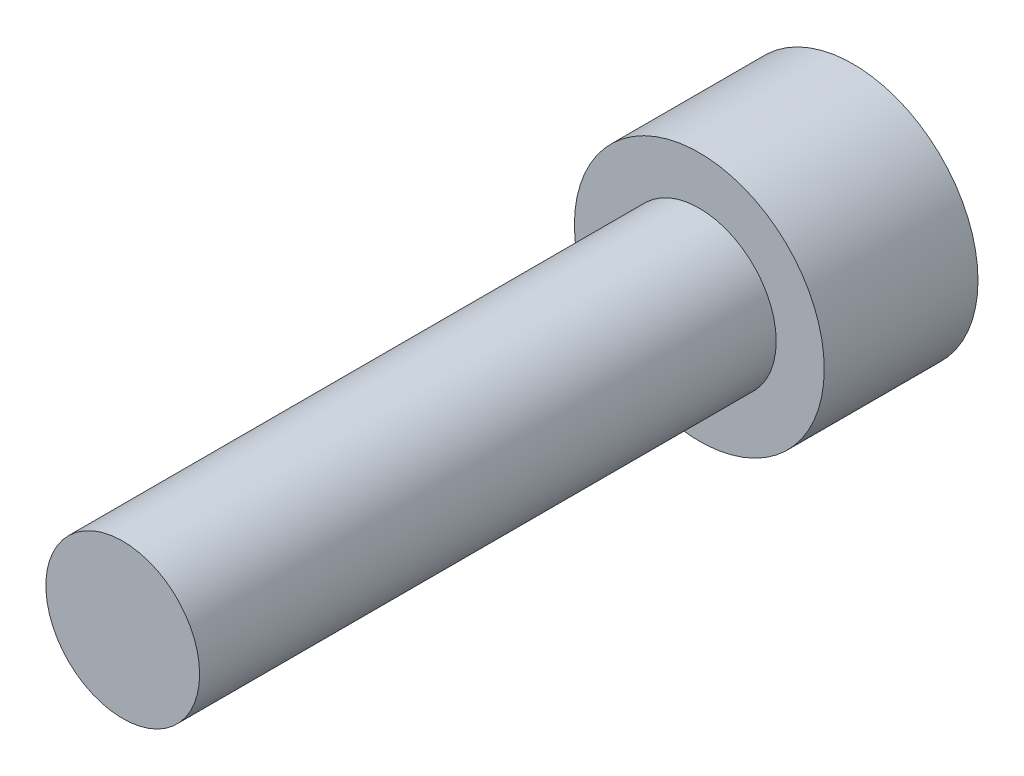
ISO-10303-21;
HEADER;
FILE_DESCRIPTION(('STEP AP214'),'2;1');
FILE_NAME('part.step','',(''),(''),'','','');
FILE_SCHEMA(('AUTOMOTIVE_DESIGN { 1 0 10303 214 1 1 1 1 }'));
ENDSEC;
DATA;
#1=APPLICATION_CONTEXT('core data for automotive mechanical design processes');
#2=APPLICATION_PROTOCOL_DEFINITION('international standard','automotive_design',2000,#1);
#3=PRODUCT_CONTEXT('',#1,'mechanical');
#4=PRODUCT('Part','Part','',(#3));
#5=PRODUCT_RELATED_PRODUCT_CATEGORY('part','',(#4));
#6=PRODUCT_DEFINITION_FORMATION('','',#4);
#7=PRODUCT_DEFINITION_CONTEXT('part definition',#1,'design');
#8=PRODUCT_DEFINITION('design','',#6,#7);
#9=PRODUCT_DEFINITION_SHAPE('','',#8);
#10=(LENGTH_UNIT() NAMED_UNIT(*) SI_UNIT(.MILLI.,.METRE.));
#11=(NAMED_UNIT(*) PLANE_ANGLE_UNIT() SI_UNIT($,.RADIAN.));
#12=(NAMED_UNIT(*) SI_UNIT($,.STERADIAN.) SOLID_ANGLE_UNIT());
#13=UNCERTAINTY_MEASURE_WITH_UNIT(LENGTH_MEASURE(1.E-05),#10,'distance_accuracy_value','');
#14=(GEOMETRIC_REPRESENTATION_CONTEXT(3) GLOBAL_UNCERTAINTY_ASSIGNED_CONTEXT((#13)) GLOBAL_UNIT_ASSIGNED_CONTEXT((#10,
#11,#12)) REPRESENTATION_CONTEXT('',''));
#15=CARTESIAN_POINT('',(0.,0.,0.));
#16=DIRECTION('',(0.,0.,1.));
#17=DIRECTION('',(1.,0.,0.));
#18=AXIS2_PLACEMENT_3D('',#15,#16,#17);
#19=CARTESIAN_POINT('',(0.,0.,30.));
#20=DIRECTION('',(0.,0.,1.));
#21=DIRECTION('',(1.,0.,0.));
#22=AXIS2_PLACEMENT_3D('',#19,#20,#21);
#23=PLANE('',#22);
#24=CARTESIAN_POINT('',(0.,0.,30.));
#25=DIRECTION('',(0.,0.,1.));
#26=DIRECTION('',(1.,0.,0.));
#27=AXIS2_PLACEMENT_3D('',#24,#25,#26);
#28=CIRCLE('',#27,4.);
#29=CARTESIAN_POINT('',(4.,0.,30.));
#30=VERTEX_POINT('',#29);
#31=EDGE_CURVE('E11',#30,#30,#28,.T.);
#32=ORIENTED_EDGE('',*,*,#31,.T.);
#33=EDGE_LOOP('',(#32));
#34=FACE_BOUND('',#33,.T.);
#35=ADVANCED_FACE('F33',(#34),#23,.T.);
#36=CARTESIAN_POINT('',(0.,0.,30.));
#37=DIRECTION('',(0.,0.,1.));
#38=DIRECTION('',(1.,0.,0.));
#39=AXIS2_PLACEMENT_3D('',#36,#37,#38);
#40=CYLINDRICAL_SURFACE('',#39,4.);
#41=CARTESIAN_POINT('',(0.,0.,0.));
#42=DIRECTION('',(0.,0.,1.));
#43=DIRECTION('',(1.,0.,0.));
#44=AXIS2_PLACEMENT_3D('',#41,#42,#43);
#45=CIRCLE('',#44,4.);
#46=CARTESIAN_POINT('',(4.,0.,0.));
#47=VERTEX_POINT('',#46);
#48=EDGE_CURVE('E40',#47,#47,#45,.T.);
#49=ORIENTED_EDGE('',*,*,#48,.T.);
#50=EDGE_LOOP('',(#49));
#51=FACE_BOUND('',#50,.T.);
#52=ORIENTED_EDGE('',*,*,#31,.F.);
#53=EDGE_LOOP('',(#52));
#54=FACE_BOUND('',#53,.T.);
#55=ADVANCED_FACE('F147',(#51,#54),#40,.T.);
#56=CARTESIAN_POINT('',(0.,-4.,0.));
#57=DIRECTION('',(0.,0.,1.));
#58=DIRECTION('',(1.,0.,0.));
#59=AXIS2_PLACEMENT_3D('',#56,#57,#58);
#60=PLANE('',#59);
#61=CARTESIAN_POINT('',(0.,0.,0.));
#62=DIRECTION('',(0.,0.,1.));
#63=DIRECTION('',(1.,0.,0.));
#64=AXIS2_PLACEMENT_3D('',#61,#62,#63);
#65=CIRCLE('',#64,6.5);
#66=CARTESIAN_POINT('',(6.5,0.,0.));
#67=VERTEX_POINT('',#66);
#68=EDGE_CURVE('E142',#67,#67,#65,.T.);
#69=ORIENTED_EDGE('',*,*,#68,.T.);
#70=EDGE_LOOP('',(#69));
#71=FACE_BOUND('',#70,.T.);
#72=ORIENTED_EDGE('',*,*,#48,.F.);
#73=EDGE_LOOP('',(#72));
#74=FACE_BOUND('',#73,.T.);
#75=ADVANCED_FACE('F150',(#71,#74),#60,.T.);
#76=CARTESIAN_POINT('',(0.,0.,30.));
#77=DIRECTION('',(0.,0.,1.));
#78=DIRECTION('',(1.,0.,0.));
#79=AXIS2_PLACEMENT_3D('',#76,#77,#78);
#80=CYLINDRICAL_SURFACE('',#79,6.5);
#81=CARTESIAN_POINT('',(0.,0.,-8.));
#82=DIRECTION('',(0.,0.,1.));
#83=DIRECTION('',(1.,0.,0.));
#84=AXIS2_PLACEMENT_3D('',#81,#82,#83);
#85=CIRCLE('',#84,6.5);
#86=CARTESIAN_POINT('',(6.5,0.,-8.));
#87=VERTEX_POINT('',#86);
#88=EDGE_CURVE('E134',#87,#87,#85,.T.);
#89=ORIENTED_EDGE('',*,*,#88,.T.);
#90=EDGE_LOOP('',(#89));
#91=FACE_BOUND('',#90,.T.);
#92=ORIENTED_EDGE('',*,*,#68,.F.);
#93=EDGE_LOOP('',(#92));
#94=FACE_BOUND('',#93,.T.);
#95=ADVANCED_FACE('F152',(#91,#94),#80,.T.);
#96=CARTESIAN_POINT('',(0.,-6.5,-8.));
#97=DIRECTION('',(0.,0.,-1.));
#98=DIRECTION('',(-1.,0.,0.));
#99=AXIS2_PLACEMENT_3D('',#96,#97,#98);
#100=PLANE('',#99);
#101=DIRECTION('',(0.866025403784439,-0.5,0.));
#102=VECTOR('',#101,1.);
#103=CARTESIAN_POINT('',(0.,3.46410161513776,-8.));
#104=LINE('',#103,#102);
#105=CARTESIAN_POINT('',(0.,3.46410161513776,-8.));
#106=VERTEX_POINT('',#105);
#107=CARTESIAN_POINT('',(3.,1.73205080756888,-8.));
#108=VERTEX_POINT('',#107);
#109=EDGE_CURVE('E47',#106,#108,#104,.T.);
#110=ORIENTED_EDGE('',*,*,#109,.F.);
#111=DIRECTION('',(0.866025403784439,0.5,0.));
#112=VECTOR('',#111,1.);
#113=CARTESIAN_POINT('',(-3.,1.73205080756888,-8.));
#114=LINE('',#113,#112);
#115=CARTESIAN_POINT('',(-3.,1.73205080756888,-8.));
#116=VERTEX_POINT('',#115);
#117=EDGE_CURVE('E130',#116,#106,#114,.T.);
#118=ORIENTED_EDGE('',*,*,#117,.F.);
#119=DIRECTION('',(0.,1.,0.));
#120=VECTOR('',#119,1.);
#121=CARTESIAN_POINT('',(-3.,-1.73205080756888,-8.));
#122=LINE('',#121,#120);
#123=CARTESIAN_POINT('',(-3.,-1.73205080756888,-8.));
#124=VERTEX_POINT('',#123);
#125=EDGE_CURVE('E128',#124,#116,#122,.T.);
#126=ORIENTED_EDGE('',*,*,#125,.F.);
#127=DIRECTION('',(-0.866025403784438,0.5,0.));
#128=VECTOR('',#127,1.);
#129=CARTESIAN_POINT('',(0.,-3.46410161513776,-8.));
#130=LINE('',#129,#128);
#131=CARTESIAN_POINT('',(0.,-3.46410161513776,-8.));
#132=VERTEX_POINT('',#131);
#133=EDGE_CURVE('E95',#132,#124,#130,.T.);
#134=ORIENTED_EDGE('',*,*,#133,.F.);
#135=DIRECTION('',(-0.866025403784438,-0.5,0.));
#136=VECTOR('',#135,1.);
#137=CARTESIAN_POINT('',(3.,-1.73205080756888,-8.));
#138=LINE('',#137,#136);
#139=CARTESIAN_POINT('',(3.,-1.73205080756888,-8.));
#140=VERTEX_POINT('',#139);
#141=EDGE_CURVE('E124',#140,#132,#138,.T.);
#142=ORIENTED_EDGE('',*,*,#141,.F.);
#143=DIRECTION('',(0.,-1.,0.));
#144=VECTOR('',#143,1.);
#145=CARTESIAN_POINT('',(3.,1.73205080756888,-8.));
#146=LINE('',#145,#144);
#147=EDGE_CURVE('E121',#108,#140,#146,.T.);
#148=ORIENTED_EDGE('',*,*,#147,.F.);
#149=EDGE_LOOP('',(#110,#118,#126,#134,#142,#148));
#150=FACE_BOUND('',#149,.T.);
#151=ORIENTED_EDGE('',*,*,#88,.F.);
#152=EDGE_LOOP('',(#151));
#153=FACE_BOUND('',#152,.T.);
#154=ADVANCED_FACE('F159',(#150,#153),#100,.T.);
#155=CARTESIAN_POINT('',(0.,3.46410161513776,-2.));
#156=DIRECTION('',(0.5,0.866025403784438,0.));
#157=DIRECTION('',(-0.866025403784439,0.5,0.));
#158=AXIS2_PLACEMENT_3D('',#155,#156,#157);
#159=PLANE('',#158);
#160=ORIENTED_EDGE('',*,*,#109,.T.);
#161=DIRECTION('',(0.,0.,-1.));
#162=VECTOR('',#161,1.);
#163=CARTESIAN_POINT('',(3.,1.73205080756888,-2.));
#164=LINE('',#163,#162);
#165=CARTESIAN_POINT('',(3.,1.73205080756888,-2.));
#166=VERTEX_POINT('',#165);
#167=EDGE_CURVE('E77',#166,#108,#164,.T.);
#168=ORIENTED_EDGE('',*,*,#167,.F.);
#169=DIRECTION('',(0.866025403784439,-0.5,0.));
#170=VECTOR('',#169,1.);
#171=CARTESIAN_POINT('',(0.,3.46410161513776,-2.));
#172=LINE('',#171,#170);
#173=CARTESIAN_POINT('',(0.,3.46410161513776,-2.));
#174=VERTEX_POINT('',#173);
#175=EDGE_CURVE('E132',#174,#166,#172,.T.);
#176=ORIENTED_EDGE('',*,*,#175,.F.);
#177=DIRECTION('',(0.,0.,-1.));
#178=VECTOR('',#177,1.);
#179=CARTESIAN_POINT('',(0.,3.46410161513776,-2.));
#180=LINE('',#179,#178);
#181=EDGE_CURVE('E55',#174,#106,#180,.T.);
#182=ORIENTED_EDGE('',*,*,#181,.T.);
#183=EDGE_LOOP('',(#160,#168,#176,#182));
#184=FACE_BOUND('',#183,.T.);
#185=ADVANCED_FACE('F190',(#184),#159,.F.);
#186=CARTESIAN_POINT('',(-3.,1.73205080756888,-2.));
#187=DIRECTION('',(-0.5,0.866025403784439,0.));
#188=DIRECTION('',(-0.866025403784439,-0.5,0.));
#189=AXIS2_PLACEMENT_3D('',#186,#187,#188);
#190=PLANE('',#189);
#191=ORIENTED_EDGE('',*,*,#117,.T.);
#192=ORIENTED_EDGE('',*,*,#181,.F.);
#193=DIRECTION('',(0.866025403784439,0.5,0.));
#194=VECTOR('',#193,1.);
#195=CARTESIAN_POINT('',(-3.,1.73205080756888,-2.));
#196=LINE('',#195,#194);
#197=CARTESIAN_POINT('',(-3.,1.73205080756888,-2.));
#198=VERTEX_POINT('',#197);
#199=EDGE_CURVE('E107',#198,#174,#196,.T.);
#200=ORIENTED_EDGE('',*,*,#199,.F.);
#201=DIRECTION('',(0.,0.,-1.));
#202=VECTOR('',#201,1.);
#203=CARTESIAN_POINT('',(-3.,1.73205080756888,-2.));
#204=LINE('',#203,#202);
#205=EDGE_CURVE('E99',#198,#116,#204,.T.);
#206=ORIENTED_EDGE('',*,*,#205,.T.);
#207=EDGE_LOOP('',(#191,#192,#200,#206));
#208=FACE_BOUND('',#207,.T.);
#209=ADVANCED_FACE('F200',(#208),#190,.F.);
#210=CARTESIAN_POINT('',(-3.,-1.73205080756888,-2.));
#211=DIRECTION('',(-1.,0.,0.));
#212=DIRECTION('',(0.,-1.,0.));
#213=AXIS2_PLACEMENT_3D('',#210,#211,#212);
#214=PLANE('',#213);
#215=ORIENTED_EDGE('',*,*,#125,.T.);
#216=ORIENTED_EDGE('',*,*,#205,.F.);
#217=DIRECTION('',(0.,1.,0.));
#218=VECTOR('',#217,1.);
#219=CARTESIAN_POINT('',(-3.,-1.73205080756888,-2.));
#220=LINE('',#219,#218);
#221=CARTESIAN_POINT('',(-3.,-1.73205080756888,-2.));
#222=VERTEX_POINT('',#221);
#223=EDGE_CURVE('E103',#222,#198,#220,.T.);
#224=ORIENTED_EDGE('',*,*,#223,.F.);
#225=DIRECTION('',(0.,0.,-1.));
#226=VECTOR('',#225,1.);
#227=CARTESIAN_POINT('',(-3.,-1.73205080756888,-2.));
#228=LINE('',#227,#226);
#229=EDGE_CURVE('E88',#222,#124,#228,.T.);
#230=ORIENTED_EDGE('',*,*,#229,.T.);
#231=EDGE_LOOP('',(#215,#216,#224,#230));
#232=FACE_BOUND('',#231,.T.);
#233=ADVANCED_FACE('F104',(#232),#214,.F.);
#234=CARTESIAN_POINT('',(0.,-3.46410161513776,-2.));
#235=DIRECTION('',(-0.5,-0.866025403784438,0.));
#236=DIRECTION('',(0.866025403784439,-0.5,0.));
#237=AXIS2_PLACEMENT_3D('',#234,#235,#236);
#238=PLANE('',#237);
#239=ORIENTED_EDGE('',*,*,#133,.T.);
#240=ORIENTED_EDGE('',*,*,#229,.F.);
#241=DIRECTION('',(-0.866025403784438,0.5,0.));
#242=VECTOR('',#241,1.);
#243=CARTESIAN_POINT('',(0.,-3.46410161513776,-2.));
#244=LINE('',#243,#242);
#245=CARTESIAN_POINT('',(0.,-3.46410161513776,-2.));
#246=VERTEX_POINT('',#245);
#247=EDGE_CURVE('E92',#246,#222,#244,.T.);
#248=ORIENTED_EDGE('',*,*,#247,.F.);
#249=DIRECTION('',(0.,0.,-1.));
#250=VECTOR('',#249,1.);
#251=CARTESIAN_POINT('',(0.,-3.46410161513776,-2.));
#252=LINE('',#251,#250);
#253=EDGE_CURVE('E100',#246,#132,#252,.T.);
#254=ORIENTED_EDGE('',*,*,#253,.T.);
#255=EDGE_LOOP('',(#239,#240,#248,#254));
#256=FACE_BOUND('',#255,.T.);
#257=ADVANCED_FACE('F90',(#256),#238,.F.);
#258=CARTESIAN_POINT('',(3.,-1.73205080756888,-2.));
#259=DIRECTION('',(0.5,-0.866025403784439,0.));
#260=DIRECTION('',(0.866025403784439,0.5,0.));
#261=AXIS2_PLACEMENT_3D('',#258,#259,#260);
#262=PLANE('',#261);
#263=ORIENTED_EDGE('',*,*,#141,.T.);
#264=ORIENTED_EDGE('',*,*,#253,.F.);
#265=DIRECTION('',(-0.866025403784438,-0.5,0.));
#266=VECTOR('',#265,1.);
#267=CARTESIAN_POINT('',(3.,-1.73205080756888,-2.));
#268=LINE('',#267,#266);
#269=CARTESIAN_POINT('',(3.,-1.73205080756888,-2.));
#270=VERTEX_POINT('',#269);
#271=EDGE_CURVE('E113',#270,#246,#268,.T.);
#272=ORIENTED_EDGE('',*,*,#271,.F.);
#273=DIRECTION('',(0.,0.,-1.));
#274=VECTOR('',#273,1.);
#275=CARTESIAN_POINT('',(3.,-1.73205080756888,-2.));
#276=LINE('',#275,#274);
#277=EDGE_CURVE('E137',#270,#140,#276,.T.);
#278=ORIENTED_EDGE('',*,*,#277,.T.);
#279=EDGE_LOOP('',(#263,#264,#272,#278));
#280=FACE_BOUND('',#279,.T.);
#281=ADVANCED_FACE('F225',(#280),#262,.F.);
#282=CARTESIAN_POINT('',(3.,1.73205080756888,-2.));
#283=DIRECTION('',(1.,0.,0.));
#284=DIRECTION('',(0.,0.,-1.));
#285=AXIS2_PLACEMENT_3D('',#282,#283,#284);
#286=PLANE('',#285);
#287=ORIENTED_EDGE('',*,*,#147,.T.);
#288=ORIENTED_EDGE('',*,*,#277,.F.);
#289=DIRECTION('',(0.,-1.,0.));
#290=VECTOR('',#289,1.);
#291=CARTESIAN_POINT('',(3.,1.73205080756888,-2.));
#292=LINE('',#291,#290);
#293=EDGE_CURVE('E115',#166,#270,#292,.T.);
#294=ORIENTED_EDGE('',*,*,#293,.F.);
#295=ORIENTED_EDGE('',*,*,#167,.T.);
#296=EDGE_LOOP('',(#287,#288,#294,#295));
#297=FACE_BOUND('',#296,.T.);
#298=ADVANCED_FACE('F234',(#297),#286,.F.);
#299=CARTESIAN_POINT('',(6.,0.,-2.));
#300=DIRECTION('',(0.,0.,-1.));
#301=DIRECTION('',(-1.,0.,0.));
#302=AXIS2_PLACEMENT_3D('',#299,#300,#301);
#303=PLANE('',#302);
#304=ORIENTED_EDGE('',*,*,#175,.T.);
#305=ORIENTED_EDGE('',*,*,#293,.T.);
#306=ORIENTED_EDGE('',*,*,#271,.T.);
#307=ORIENTED_EDGE('',*,*,#247,.T.);
#308=ORIENTED_EDGE('',*,*,#223,.T.);
#309=ORIENTED_EDGE('',*,*,#199,.T.);
#310=EDGE_LOOP('',(#304,#305,#306,#307,#308,#309));
#311=FACE_BOUND('',#310,.T.);
#312=ADVANCED_FACE('F110',(#311),#303,.T.);
#313=CLOSED_SHELL('',(#35,#55,#75,#95,#154,#185,#209,#233,#257,#281,#298,#312));
#314=MANIFOLD_SOLID_BREP('B2',#313);
#315=ADVANCED_BREP_SHAPE_REPRESENTATION('',(#18,#314),#14);
#316=SHAPE_DEFINITION_REPRESENTATION(#9,#315);
ENDSEC;
END-ISO-10303-21;
